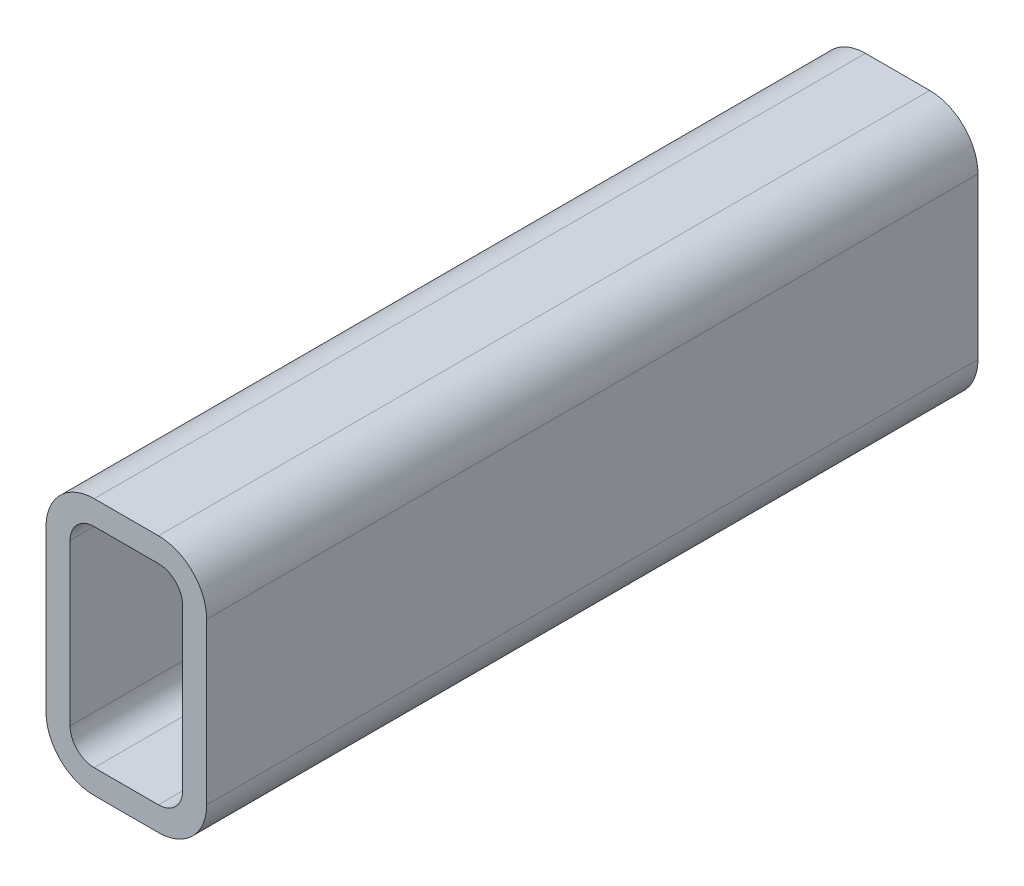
ISO-10303-21;
HEADER;
FILE_DESCRIPTION(('STEP AP214'),'2;1');
FILE_NAME('part.step','',(''),(''),'','','');
FILE_SCHEMA(('AUTOMOTIVE_DESIGN { 1 0 10303 214 1 1 1 1 }'));
ENDSEC;
DATA;
#1=APPLICATION_CONTEXT('core data for automotive mechanical design processes');
#2=APPLICATION_PROTOCOL_DEFINITION('international standard','automotive_design',2000,#1);
#3=PRODUCT_CONTEXT('',#1,'mechanical');
#4=PRODUCT('Part','Part','',(#3));
#5=PRODUCT_RELATED_PRODUCT_CATEGORY('part','',(#4));
#6=PRODUCT_DEFINITION_FORMATION('','',#4);
#7=PRODUCT_DEFINITION_CONTEXT('part definition',#1,'design');
#8=PRODUCT_DEFINITION('design','',#6,#7);
#9=PRODUCT_DEFINITION_SHAPE('','',#8);
#10=(LENGTH_UNIT() NAMED_UNIT(*) SI_UNIT(.MILLI.,.METRE.));
#11=(NAMED_UNIT(*) PLANE_ANGLE_UNIT() SI_UNIT($,.RADIAN.));
#12=(NAMED_UNIT(*) SI_UNIT($,.STERADIAN.) SOLID_ANGLE_UNIT());
#13=UNCERTAINTY_MEASURE_WITH_UNIT(LENGTH_MEASURE(1.E-05),#10,'distance_accuracy_value','');
#14=(GEOMETRIC_REPRESENTATION_CONTEXT(3) GLOBAL_UNCERTAINTY_ASSIGNED_CONTEXT((#13)) GLOBAL_UNIT_ASSIGNED_CONTEXT((#10,
#11,#12)) REPRESENTATION_CONTEXT('',''));
#15=CARTESIAN_POINT('',(0.,0.,0.));
#16=DIRECTION('',(0.,0.,1.));
#17=DIRECTION('',(1.,0.,0.));
#18=AXIS2_PLACEMENT_3D('',#15,#16,#17);
#19=CARTESIAN_POINT('',(21.9460851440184,84.6077651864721,304.8));
#20=DIRECTION('',(0.,0.,1.));
#21=DIRECTION('',(1.,0.,0.));
#22=AXIS2_PLACEMENT_3D('',#19,#20,#21);
#23=PLANE('',#22);
#24=CARTESIAN_POINT('',(21.9460851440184,84.6077651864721,304.8));
#25=DIRECTION('',(0.,0.,1.));
#26=DIRECTION('',(1.,0.,0.));
#27=AXIS2_PLACEMENT_3D('',#24,#25,#26);
#28=CIRCLE('',#27,19.05);
#29=CARTESIAN_POINT('',(21.9460851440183,103.657765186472,304.8));
#30=VERTEX_POINT('',#29);
#31=CARTESIAN_POINT('',(2.89608514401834,84.6077651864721,304.8));
#32=VERTEX_POINT('',#31);
#33=EDGE_CURVE('E211',#30,#32,#28,.T.);
#34=ORIENTED_EDGE('',*,*,#33,.T.);
#35=DIRECTION('',(0.,-1.,0.));
#36=VECTOR('',#35,1.);
#37=CARTESIAN_POINT('',(2.89608514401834,21.1077651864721,304.8));
#38=LINE('',#37,#36);
#39=CARTESIAN_POINT('',(2.89608514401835,21.1077651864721,304.8));
#40=VERTEX_POINT('',#39);
#41=EDGE_CURVE('E214',#32,#40,#38,.T.);
#42=ORIENTED_EDGE('',*,*,#41,.T.);
#43=CARTESIAN_POINT('',(21.9460851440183,21.1077651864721,304.8));
#44=DIRECTION('',(0.,0.,1.));
#45=DIRECTION('',(1.,0.,0.));
#46=AXIS2_PLACEMENT_3D('',#43,#44,#45);
#47=CIRCLE('',#46,19.05);
#48=CARTESIAN_POINT('',(21.9460851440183,2.05776518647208,304.8));
#49=VERTEX_POINT('',#48);
#50=EDGE_CURVE('E217',#40,#49,#47,.T.);
#51=ORIENTED_EDGE('',*,*,#50,.T.);
#52=DIRECTION('',(1.,0.,0.));
#53=VECTOR('',#52,1.);
#54=CARTESIAN_POINT('',(47.3460851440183,2.05776518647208,304.8));
#55=LINE('',#54,#53);
#56=CARTESIAN_POINT('',(47.3460851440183,2.05776518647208,304.8));
#57=VERTEX_POINT('',#56);
#58=EDGE_CURVE('E219',#49,#57,#55,.T.);
#59=ORIENTED_EDGE('',*,*,#58,.T.);
#60=CARTESIAN_POINT('',(47.3460851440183,21.1077651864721,304.8));
#61=DIRECTION('',(0.,0.,1.));
#62=DIRECTION('',(1.,0.,0.));
#63=AXIS2_PLACEMENT_3D('',#60,#61,#62);
#64=CIRCLE('',#63,19.05);
#65=CARTESIAN_POINT('',(66.3960851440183,21.1077651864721,304.8));
#66=VERTEX_POINT('',#65);
#67=EDGE_CURVE('E221',#57,#66,#64,.T.);
#68=ORIENTED_EDGE('',*,*,#67,.T.);
#69=DIRECTION('',(0.,1.,0.));
#70=VECTOR('',#69,1.);
#71=CARTESIAN_POINT('',(66.3960851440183,84.6077651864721,304.8));
#72=LINE('',#71,#70);
#73=CARTESIAN_POINT('',(66.3960851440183,84.6077651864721,304.8));
#74=VERTEX_POINT('',#73);
#75=EDGE_CURVE('E223',#66,#74,#72,.T.);
#76=ORIENTED_EDGE('',*,*,#75,.T.);
#77=CARTESIAN_POINT('',(47.3460851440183,84.6077651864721,304.8));
#78=DIRECTION('',(0.,0.,1.));
#79=DIRECTION('',(1.,0.,0.));
#80=AXIS2_PLACEMENT_3D('',#77,#78,#79);
#81=CIRCLE('',#80,19.05);
#82=CARTESIAN_POINT('',(47.3460851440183,103.657765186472,304.8));
#83=VERTEX_POINT('',#82);
#84=EDGE_CURVE('E225',#74,#83,#81,.T.);
#85=ORIENTED_EDGE('',*,*,#84,.T.);
#86=DIRECTION('',(-1.,0.,0.));
#87=VECTOR('',#86,1.);
#88=CARTESIAN_POINT('',(21.9460851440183,103.657765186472,304.8));
#89=LINE('',#88,#87);
#90=EDGE_CURVE('E227',#83,#30,#89,.T.);
#91=ORIENTED_EDGE('',*,*,#90,.T.);
#92=EDGE_LOOP('',(#34,#42,#51,#59,#68,#76,#85,#91));
#93=FACE_BOUND('',#92,.T.);
#94=DIRECTION('',(0.,-1.,0.));
#95=VECTOR('',#94,1.);
#96=CARTESIAN_POINT('',(12.4210851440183,21.1077651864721,304.8));
#97=LINE('',#96,#95);
#98=CARTESIAN_POINT('',(12.4210851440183,84.6077651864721,304.8));
#99=VERTEX_POINT('',#98);
#100=CARTESIAN_POINT('',(12.4210851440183,21.1077651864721,304.8));
#101=VERTEX_POINT('',#100);
#102=EDGE_CURVE('E154',#99,#101,#97,.T.);
#103=ORIENTED_EDGE('',*,*,#102,.F.);
#104=CARTESIAN_POINT('',(21.9460851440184,84.6077651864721,304.8));
#105=DIRECTION('',(0.,0.,1.));
#106=DIRECTION('',(1.,0.,0.));
#107=AXIS2_PLACEMENT_3D('',#104,#105,#106);
#108=CIRCLE('',#107,9.52500000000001);
#109=CARTESIAN_POINT('',(21.9460851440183,94.1327651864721,304.8));
#110=VERTEX_POINT('',#109);
#111=EDGE_CURVE('E146',#110,#99,#108,.T.);
#112=ORIENTED_EDGE('',*,*,#111,.F.);
#113=DIRECTION('',(-1.,0.,0.));
#114=VECTOR('',#113,1.);
#115=CARTESIAN_POINT('',(21.9460851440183,94.1327651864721,304.8));
#116=LINE('',#115,#114);
#117=CARTESIAN_POINT('',(47.3460851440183,94.1327651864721,304.8));
#118=VERTEX_POINT('',#117);
#119=EDGE_CURVE('E179',#118,#110,#116,.T.);
#120=ORIENTED_EDGE('',*,*,#119,.F.);
#121=CARTESIAN_POINT('',(47.3460851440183,84.6077651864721,304.8));
#122=DIRECTION('',(0.,0.,1.));
#123=DIRECTION('',(1.,0.,0.));
#124=AXIS2_PLACEMENT_3D('',#121,#122,#123);
#125=CIRCLE('',#124,9.52500000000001);
#126=CARTESIAN_POINT('',(56.8710851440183,84.6077651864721,304.8));
#127=VERTEX_POINT('',#126);
#128=EDGE_CURVE('E177',#127,#118,#125,.T.);
#129=ORIENTED_EDGE('',*,*,#128,.F.);
#130=DIRECTION('',(0.,1.,0.));
#131=VECTOR('',#130,1.);
#132=CARTESIAN_POINT('',(56.8710851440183,84.6077651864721,304.8));
#133=LINE('',#132,#131);
#134=CARTESIAN_POINT('',(56.8710851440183,21.1077651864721,304.8));
#135=VERTEX_POINT('',#134);
#136=EDGE_CURVE('E175',#135,#127,#133,.T.);
#137=ORIENTED_EDGE('',*,*,#136,.F.);
#138=CARTESIAN_POINT('',(47.3460851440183,21.1077651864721,304.8));
#139=DIRECTION('',(0.,0.,1.));
#140=DIRECTION('',(1.,0.,0.));
#141=AXIS2_PLACEMENT_3D('',#138,#139,#140);
#142=CIRCLE('',#141,9.525);
#143=CARTESIAN_POINT('',(47.3460851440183,11.5827651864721,304.8));
#144=VERTEX_POINT('',#143);
#145=EDGE_CURVE('E173',#144,#135,#142,.T.);
#146=ORIENTED_EDGE('',*,*,#145,.F.);
#147=DIRECTION('',(1.,0.,0.));
#148=VECTOR('',#147,1.);
#149=CARTESIAN_POINT('',(47.3460851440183,11.5827651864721,304.8));
#150=LINE('',#149,#148);
#151=CARTESIAN_POINT('',(21.9460851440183,11.5827651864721,304.8));
#152=VERTEX_POINT('',#151);
#153=EDGE_CURVE('E169',#152,#144,#150,.T.);
#154=ORIENTED_EDGE('',*,*,#153,.F.);
#155=CARTESIAN_POINT('',(21.9460851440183,21.1077651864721,304.8));
#156=DIRECTION('',(0.,0.,1.));
#157=DIRECTION('',(1.,0.,0.));
#158=AXIS2_PLACEMENT_3D('',#155,#156,#157);
#159=CIRCLE('',#158,9.525);
#160=EDGE_CURVE('E167',#101,#152,#159,.T.);
#161=ORIENTED_EDGE('',*,*,#160,.F.);
#162=EDGE_LOOP('',(#103,#112,#120,#129,#137,#146,#154,#161));
#163=FACE_BOUND('',#162,.T.);
#164=ADVANCED_FACE('F33',(#93,#163),#23,.T.);
#165=CARTESIAN_POINT('',(21.9460851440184,84.6077651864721,0.));
#166=DIRECTION('',(0.,0.,1.));
#167=DIRECTION('',(1.,0.,0.));
#168=AXIS2_PLACEMENT_3D('',#165,#166,#167);
#169=PLANE('',#168);
#170=CARTESIAN_POINT('',(21.9460851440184,84.6077651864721,0.));
#171=DIRECTION('',(0.,0.,1.));
#172=DIRECTION('',(1.,0.,0.));
#173=AXIS2_PLACEMENT_3D('',#170,#171,#172);
#174=CIRCLE('',#173,19.05);
#175=CARTESIAN_POINT('',(21.9460851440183,103.657765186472,0.));
#176=VERTEX_POINT('',#175);
#177=CARTESIAN_POINT('',(2.89608514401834,84.6077651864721,0.));
#178=VERTEX_POINT('',#177);
#179=EDGE_CURVE('E162',#176,#178,#174,.T.);
#180=ORIENTED_EDGE('',*,*,#179,.F.);
#181=DIRECTION('',(-1.,0.,0.));
#182=VECTOR('',#181,1.);
#183=CARTESIAN_POINT('',(21.9460851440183,103.657765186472,0.));
#184=LINE('',#183,#182);
#185=CARTESIAN_POINT('',(47.3460851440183,103.657765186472,0.));
#186=VERTEX_POINT('',#185);
#187=EDGE_CURVE('E215',#186,#176,#184,.T.);
#188=ORIENTED_EDGE('',*,*,#187,.F.);
#189=CARTESIAN_POINT('',(47.3460851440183,84.6077651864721,0.));
#190=DIRECTION('',(0.,0.,1.));
#191=DIRECTION('',(1.,0.,0.));
#192=AXIS2_PLACEMENT_3D('',#189,#190,#191);
#193=CIRCLE('',#192,19.05);
#194=CARTESIAN_POINT('',(66.3960851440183,84.6077651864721,0.));
#195=VERTEX_POINT('',#194);
#196=EDGE_CURVE('E242',#195,#186,#193,.T.);
#197=ORIENTED_EDGE('',*,*,#196,.F.);
#198=DIRECTION('',(0.,1.,0.));
#199=VECTOR('',#198,1.);
#200=CARTESIAN_POINT('',(66.3960851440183,84.6077651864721,0.));
#201=LINE('',#200,#199);
#202=CARTESIAN_POINT('',(66.3960851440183,21.1077651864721,0.));
#203=VERTEX_POINT('',#202);
#204=EDGE_CURVE('E240',#203,#195,#201,.T.);
#205=ORIENTED_EDGE('',*,*,#204,.F.);
#206=CARTESIAN_POINT('',(47.3460851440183,21.1077651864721,0.));
#207=DIRECTION('',(0.,0.,1.));
#208=DIRECTION('',(1.,0.,0.));
#209=AXIS2_PLACEMENT_3D('',#206,#207,#208);
#210=CIRCLE('',#209,19.05);
#211=CARTESIAN_POINT('',(47.3460851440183,2.05776518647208,0.));
#212=VERTEX_POINT('',#211);
#213=EDGE_CURVE('E238',#212,#203,#210,.T.);
#214=ORIENTED_EDGE('',*,*,#213,.F.);
#215=DIRECTION('',(1.,0.,0.));
#216=VECTOR('',#215,1.);
#217=CARTESIAN_POINT('',(47.3460851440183,2.05776518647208,0.));
#218=LINE('',#217,#216);
#219=CARTESIAN_POINT('',(21.9460851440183,2.05776518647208,0.));
#220=VERTEX_POINT('',#219);
#221=EDGE_CURVE('E236',#220,#212,#218,.T.);
#222=ORIENTED_EDGE('',*,*,#221,.F.);
#223=CARTESIAN_POINT('',(21.9460851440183,21.1077651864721,0.));
#224=DIRECTION('',(0.,0.,1.));
#225=DIRECTION('',(1.,0.,0.));
#226=AXIS2_PLACEMENT_3D('',#223,#224,#225);
#227=CIRCLE('',#226,19.05);
#228=CARTESIAN_POINT('',(2.89608514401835,21.1077651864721,0.));
#229=VERTEX_POINT('',#228);
#230=EDGE_CURVE('E234',#229,#220,#227,.T.);
#231=ORIENTED_EDGE('',*,*,#230,.F.);
#232=DIRECTION('',(0.,-1.,0.));
#233=VECTOR('',#232,1.);
#234=CARTESIAN_POINT('',(2.89608514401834,21.1077651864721,0.));
#235=LINE('',#234,#233);
#236=EDGE_CURVE('E232',#178,#229,#235,.T.);
#237=ORIENTED_EDGE('',*,*,#236,.F.);
#238=EDGE_LOOP('',(#180,#188,#197,#205,#214,#222,#231,#237));
#239=FACE_BOUND('',#238,.T.);
#240=CARTESIAN_POINT('',(21.9460851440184,84.6077651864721,0.));
#241=DIRECTION('',(0.,0.,1.));
#242=DIRECTION('',(1.,0.,0.));
#243=AXIS2_PLACEMENT_3D('',#240,#241,#242);
#244=CIRCLE('',#243,9.52500000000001);
#245=CARTESIAN_POINT('',(21.9460851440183,94.1327651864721,0.));
#246=VERTEX_POINT('',#245);
#247=CARTESIAN_POINT('',(12.4210851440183,84.6077651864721,0.));
#248=VERTEX_POINT('',#247);
#249=EDGE_CURVE('E56',#246,#248,#244,.T.);
#250=ORIENTED_EDGE('',*,*,#249,.T.);
#251=DIRECTION('',(0.,-1.,0.));
#252=VECTOR('',#251,1.);
#253=CARTESIAN_POINT('',(12.4210851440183,21.1077651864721,0.));
#254=LINE('',#253,#252);
#255=CARTESIAN_POINT('',(12.4210851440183,21.1077651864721,0.));
#256=VERTEX_POINT('',#255);
#257=EDGE_CURVE('E161',#248,#256,#254,.T.);
#258=ORIENTED_EDGE('',*,*,#257,.T.);
#259=CARTESIAN_POINT('',(21.9460851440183,21.1077651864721,0.));
#260=DIRECTION('',(0.,0.,1.));
#261=DIRECTION('',(1.,0.,0.));
#262=AXIS2_PLACEMENT_3D('',#259,#260,#261);
#263=CIRCLE('',#262,9.525);
#264=CARTESIAN_POINT('',(21.9460851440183,11.5827651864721,0.));
#265=VERTEX_POINT('',#264);
#266=EDGE_CURVE('E183',#256,#265,#263,.T.);
#267=ORIENTED_EDGE('',*,*,#266,.T.);
#268=DIRECTION('',(1.,0.,0.));
#269=VECTOR('',#268,1.);
#270=CARTESIAN_POINT('',(47.3460851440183,11.5827651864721,0.));
#271=LINE('',#270,#269);
#272=CARTESIAN_POINT('',(47.3460851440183,11.5827651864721,0.));
#273=VERTEX_POINT('',#272);
#274=EDGE_CURVE('E186',#265,#273,#271,.T.);
#275=ORIENTED_EDGE('',*,*,#274,.T.);
#276=CARTESIAN_POINT('',(47.3460851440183,21.1077651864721,0.));
#277=DIRECTION('',(0.,0.,1.));
#278=DIRECTION('',(1.,0.,0.));
#279=AXIS2_PLACEMENT_3D('',#276,#277,#278);
#280=CIRCLE('',#279,9.525);
#281=CARTESIAN_POINT('',(56.8710851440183,21.1077651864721,0.));
#282=VERTEX_POINT('',#281);
#283=EDGE_CURVE('E189',#273,#282,#280,.T.);
#284=ORIENTED_EDGE('',*,*,#283,.T.);
#285=DIRECTION('',(0.,1.,0.));
#286=VECTOR('',#285,1.);
#287=CARTESIAN_POINT('',(56.8710851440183,84.6077651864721,0.));
#288=LINE('',#287,#286);
#289=CARTESIAN_POINT('',(56.8710851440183,84.6077651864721,0.));
#290=VERTEX_POINT('',#289);
#291=EDGE_CURVE('E192',#282,#290,#288,.T.);
#292=ORIENTED_EDGE('',*,*,#291,.T.);
#293=CARTESIAN_POINT('',(47.3460851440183,84.6077651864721,0.));
#294=DIRECTION('',(0.,0.,1.));
#295=DIRECTION('',(1.,0.,0.));
#296=AXIS2_PLACEMENT_3D('',#293,#294,#295);
#297=CIRCLE('',#296,9.52500000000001);
#298=CARTESIAN_POINT('',(47.3460851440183,94.1327651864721,0.));
#299=VERTEX_POINT('',#298);
#300=EDGE_CURVE('E195',#290,#299,#297,.T.);
#301=ORIENTED_EDGE('',*,*,#300,.T.);
#302=DIRECTION('',(-1.,0.,0.));
#303=VECTOR('',#302,1.);
#304=CARTESIAN_POINT('',(21.9460851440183,94.1327651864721,0.));
#305=LINE('',#304,#303);
#306=EDGE_CURVE('E155',#299,#246,#305,.T.);
#307=ORIENTED_EDGE('',*,*,#306,.T.);
#308=EDGE_LOOP('',(#250,#258,#267,#275,#284,#292,#301,#307));
#309=FACE_BOUND('',#308,.T.);
#310=ADVANCED_FACE('F272',(#239,#309),#169,.F.);
#311=CARTESIAN_POINT('',(21.9460851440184,84.6077651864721,304.8));
#312=DIRECTION('',(0.,0.,-1.));
#313=DIRECTION('',(-1.,0.,0.));
#314=AXIS2_PLACEMENT_3D('',#311,#312,#313);
#315=CYLINDRICAL_SURFACE('',#314,19.05);
#316=ORIENTED_EDGE('',*,*,#179,.T.);
#317=DIRECTION('',(0.,0.,-1.));
#318=VECTOR('',#317,1.);
#319=CARTESIAN_POINT('',(2.89608514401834,84.6077651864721,304.8));
#320=LINE('',#319,#318);
#321=EDGE_CURVE('E11',#32,#178,#320,.T.);
#322=ORIENTED_EDGE('',*,*,#321,.F.);
#323=ORIENTED_EDGE('',*,*,#33,.F.);
#324=DIRECTION('',(0.,0.,-1.));
#325=VECTOR('',#324,1.);
#326=CARTESIAN_POINT('',(21.9460851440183,103.657765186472,304.8));
#327=LINE('',#326,#325);
#328=EDGE_CURVE('E229',#30,#176,#327,.T.);
#329=ORIENTED_EDGE('',*,*,#328,.T.);
#330=EDGE_LOOP('',(#316,#322,#323,#329));
#331=FACE_BOUND('',#330,.T.);
#332=ADVANCED_FACE('F35',(#331),#315,.T.);
#333=CARTESIAN_POINT('',(2.89608514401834,21.1077651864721,304.8));
#334=DIRECTION('',(1.,0.,0.));
#335=DIRECTION('',(0.,0.,-1.));
#336=AXIS2_PLACEMENT_3D('',#333,#334,#335);
#337=PLANE('',#336);
#338=ORIENTED_EDGE('',*,*,#236,.T.);
#339=DIRECTION('',(0.,0.,-1.));
#340=VECTOR('',#339,1.);
#341=CARTESIAN_POINT('',(2.89608514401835,21.1077651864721,304.8));
#342=LINE('',#341,#340);
#343=EDGE_CURVE('E41',#40,#229,#342,.T.);
#344=ORIENTED_EDGE('',*,*,#343,.F.);
#345=ORIENTED_EDGE('',*,*,#41,.F.);
#346=ORIENTED_EDGE('',*,*,#321,.T.);
#347=EDGE_LOOP('',(#338,#344,#345,#346));
#348=FACE_BOUND('',#347,.T.);
#349=ADVANCED_FACE('F289',(#348),#337,.F.);
#350=CARTESIAN_POINT('',(21.9460851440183,21.1077651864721,304.8));
#351=DIRECTION('',(0.,0.,-1.));
#352=DIRECTION('',(-1.,0.,0.));
#353=AXIS2_PLACEMENT_3D('',#350,#351,#352);
#354=CYLINDRICAL_SURFACE('',#353,19.05);
#355=ORIENTED_EDGE('',*,*,#230,.T.);
#356=DIRECTION('',(0.,0.,-1.));
#357=VECTOR('',#356,1.);
#358=CARTESIAN_POINT('',(21.9460851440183,2.05776518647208,304.8));
#359=LINE('',#358,#357);
#360=EDGE_CURVE('E259',#49,#220,#359,.T.);
#361=ORIENTED_EDGE('',*,*,#360,.F.);
#362=ORIENTED_EDGE('',*,*,#50,.F.);
#363=ORIENTED_EDGE('',*,*,#343,.T.);
#364=EDGE_LOOP('',(#355,#361,#362,#363));
#365=FACE_BOUND('',#364,.T.);
#366=ADVANCED_FACE('F266',(#365),#354,.T.);
#367=CARTESIAN_POINT('',(47.3460851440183,2.05776518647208,304.8));
#368=DIRECTION('',(0.,1.,0.));
#369=DIRECTION('',(0.,0.,1.));
#370=AXIS2_PLACEMENT_3D('',#367,#368,#369);
#371=PLANE('',#370);
#372=ORIENTED_EDGE('',*,*,#221,.T.);
#373=DIRECTION('',(0.,0.,-1.));
#374=VECTOR('',#373,1.);
#375=CARTESIAN_POINT('',(47.3460851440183,2.05776518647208,304.8));
#376=LINE('',#375,#374);
#377=EDGE_CURVE('E256',#57,#212,#376,.T.);
#378=ORIENTED_EDGE('',*,*,#377,.F.);
#379=ORIENTED_EDGE('',*,*,#58,.F.);
#380=ORIENTED_EDGE('',*,*,#360,.T.);
#381=EDGE_LOOP('',(#372,#378,#379,#380));
#382=FACE_BOUND('',#381,.T.);
#383=ADVANCED_FACE('F278',(#382),#371,.F.);
#384=CARTESIAN_POINT('',(47.3460851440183,21.1077651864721,304.8));
#385=DIRECTION('',(0.,0.,-1.));
#386=DIRECTION('',(-1.,0.,0.));
#387=AXIS2_PLACEMENT_3D('',#384,#385,#386);
#388=CYLINDRICAL_SURFACE('',#387,19.05);
#389=ORIENTED_EDGE('',*,*,#213,.T.);
#390=DIRECTION('',(0.,0.,-1.));
#391=VECTOR('',#390,1.);
#392=CARTESIAN_POINT('',(66.3960851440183,21.1077651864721,304.8));
#393=LINE('',#392,#391);
#394=EDGE_CURVE('E253',#66,#203,#393,.T.);
#395=ORIENTED_EDGE('',*,*,#394,.F.);
#396=ORIENTED_EDGE('',*,*,#67,.F.);
#397=ORIENTED_EDGE('',*,*,#377,.T.);
#398=EDGE_LOOP('',(#389,#395,#396,#397));
#399=FACE_BOUND('',#398,.T.);
#400=ADVANCED_FACE('F282',(#399),#388,.T.);
#401=CARTESIAN_POINT('',(66.3960851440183,84.6077651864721,304.8));
#402=DIRECTION('',(-1.,0.,0.));
#403=DIRECTION('',(0.,0.,1.));
#404=AXIS2_PLACEMENT_3D('',#401,#402,#403);
#405=PLANE('',#404);
#406=ORIENTED_EDGE('',*,*,#204,.T.);
#407=DIRECTION('',(0.,0.,-1.));
#408=VECTOR('',#407,1.);
#409=CARTESIAN_POINT('',(66.3960851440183,84.6077651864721,304.8));
#410=LINE('',#409,#408);
#411=EDGE_CURVE('E250',#74,#195,#410,.T.);
#412=ORIENTED_EDGE('',*,*,#411,.F.);
#413=ORIENTED_EDGE('',*,*,#75,.F.);
#414=ORIENTED_EDGE('',*,*,#394,.T.);
#415=EDGE_LOOP('',(#406,#412,#413,#414));
#416=FACE_BOUND('',#415,.T.);
#417=ADVANCED_FACE('F302',(#416),#405,.F.);
#418=CARTESIAN_POINT('',(47.3460851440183,84.6077651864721,304.8));
#419=DIRECTION('',(0.,0.,-1.));
#420=DIRECTION('',(-1.,0.,0.));
#421=AXIS2_PLACEMENT_3D('',#418,#419,#420);
#422=CYLINDRICAL_SURFACE('',#421,19.05);
#423=ORIENTED_EDGE('',*,*,#196,.T.);
#424=DIRECTION('',(0.,0.,-1.));
#425=VECTOR('',#424,1.);
#426=CARTESIAN_POINT('',(47.3460851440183,103.657765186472,304.8));
#427=LINE('',#426,#425);
#428=EDGE_CURVE('E247',#83,#186,#427,.T.);
#429=ORIENTED_EDGE('',*,*,#428,.F.);
#430=ORIENTED_EDGE('',*,*,#84,.F.);
#431=ORIENTED_EDGE('',*,*,#411,.T.);
#432=EDGE_LOOP('',(#423,#429,#430,#431));
#433=FACE_BOUND('',#432,.T.);
#434=ADVANCED_FACE('F300',(#433),#422,.T.);
#435=CARTESIAN_POINT('',(21.9460851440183,103.657765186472,304.8));
#436=DIRECTION('',(0.,-1.,0.));
#437=DIRECTION('',(0.,0.,-1.));
#438=AXIS2_PLACEMENT_3D('',#435,#436,#437);
#439=PLANE('',#438);
#440=ORIENTED_EDGE('',*,*,#187,.T.);
#441=ORIENTED_EDGE('',*,*,#328,.F.);
#442=ORIENTED_EDGE('',*,*,#90,.F.);
#443=ORIENTED_EDGE('',*,*,#428,.T.);
#444=EDGE_LOOP('',(#440,#441,#442,#443));
#445=FACE_BOUND('',#444,.T.);
#446=ADVANCED_FACE('F295',(#445),#439,.F.);
#447=CARTESIAN_POINT('',(21.9460851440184,84.6077651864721,304.8));
#448=DIRECTION('',(0.,0.,-1.));
#449=DIRECTION('',(-1.,0.,0.));
#450=AXIS2_PLACEMENT_3D('',#447,#448,#449);
#451=CYLINDRICAL_SURFACE('',#450,9.52500000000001);
#452=ORIENTED_EDGE('',*,*,#249,.F.);
#453=DIRECTION('',(0.,0.,-1.));
#454=VECTOR('',#453,1.);
#455=CARTESIAN_POINT('',(21.9460851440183,94.1327651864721,304.8));
#456=LINE('',#455,#454);
#457=EDGE_CURVE('E150',#110,#246,#456,.T.);
#458=ORIENTED_EDGE('',*,*,#457,.F.);
#459=ORIENTED_EDGE('',*,*,#111,.T.);
#460=DIRECTION('',(0.,0.,-1.));
#461=VECTOR('',#460,1.);
#462=CARTESIAN_POINT('',(12.4210851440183,84.6077651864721,304.8));
#463=LINE('',#462,#461);
#464=EDGE_CURVE('E149',#99,#248,#463,.T.);
#465=ORIENTED_EDGE('',*,*,#464,.T.);
#466=EDGE_LOOP('',(#452,#458,#459,#465));
#467=FACE_BOUND('',#466,.T.);
#468=ADVANCED_FACE('F148',(#467),#451,.F.);
#469=CARTESIAN_POINT('',(12.4210851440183,21.1077651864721,304.8));
#470=DIRECTION('',(1.,0.,0.));
#471=DIRECTION('',(0.,0.,-1.));
#472=AXIS2_PLACEMENT_3D('',#469,#470,#471);
#473=PLANE('',#472);
#474=ORIENTED_EDGE('',*,*,#257,.F.);
#475=ORIENTED_EDGE('',*,*,#464,.F.);
#476=ORIENTED_EDGE('',*,*,#102,.T.);
#477=DIRECTION('',(0.,0.,-1.));
#478=VECTOR('',#477,1.);
#479=CARTESIAN_POINT('',(12.4210851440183,21.1077651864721,304.8));
#480=LINE('',#479,#478);
#481=EDGE_CURVE('E163',#101,#256,#480,.T.);
#482=ORIENTED_EDGE('',*,*,#481,.T.);
#483=EDGE_LOOP('',(#474,#475,#476,#482));
#484=FACE_BOUND('',#483,.T.);
#485=ADVANCED_FACE('F158',(#484),#473,.T.);
#486=CARTESIAN_POINT('',(21.9460851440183,21.1077651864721,304.8));
#487=DIRECTION('',(0.,0.,-1.));
#488=DIRECTION('',(-1.,0.,0.));
#489=AXIS2_PLACEMENT_3D('',#486,#487,#488);
#490=CYLINDRICAL_SURFACE('',#489,9.525);
#491=ORIENTED_EDGE('',*,*,#266,.F.);
#492=ORIENTED_EDGE('',*,*,#481,.F.);
#493=ORIENTED_EDGE('',*,*,#160,.T.);
#494=DIRECTION('',(0.,0.,-1.));
#495=VECTOR('',#494,1.);
#496=CARTESIAN_POINT('',(21.9460851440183,11.5827651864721,304.8));
#497=LINE('',#496,#495);
#498=EDGE_CURVE('E208',#152,#265,#497,.T.);
#499=ORIENTED_EDGE('',*,*,#498,.T.);
#500=EDGE_LOOP('',(#491,#492,#493,#499));
#501=FACE_BOUND('',#500,.T.);
#502=ADVANCED_FACE('F327',(#501),#490,.F.);
#503=CARTESIAN_POINT('',(47.3460851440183,11.5827651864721,304.8));
#504=DIRECTION('',(0.,1.,0.));
#505=DIRECTION('',(0.,0.,1.));
#506=AXIS2_PLACEMENT_3D('',#503,#504,#505);
#507=PLANE('',#506);
#508=ORIENTED_EDGE('',*,*,#274,.F.);
#509=ORIENTED_EDGE('',*,*,#498,.F.);
#510=ORIENTED_EDGE('',*,*,#153,.T.);
#511=DIRECTION('',(0.,0.,-1.));
#512=VECTOR('',#511,1.);
#513=CARTESIAN_POINT('',(47.3460851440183,11.5827651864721,304.8));
#514=LINE('',#513,#512);
#515=EDGE_CURVE('E206',#144,#273,#514,.T.);
#516=ORIENTED_EDGE('',*,*,#515,.T.);
#517=EDGE_LOOP('',(#508,#509,#510,#516));
#518=FACE_BOUND('',#517,.T.);
#519=ADVANCED_FACE('F331',(#518),#507,.T.);
#520=CARTESIAN_POINT('',(47.3460851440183,21.1077651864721,304.8));
#521=DIRECTION('',(0.,0.,-1.));
#522=DIRECTION('',(-1.,0.,0.));
#523=AXIS2_PLACEMENT_3D('',#520,#521,#522);
#524=CYLINDRICAL_SURFACE('',#523,9.525);
#525=ORIENTED_EDGE('',*,*,#283,.F.);
#526=ORIENTED_EDGE('',*,*,#515,.F.);
#527=ORIENTED_EDGE('',*,*,#145,.T.);
#528=DIRECTION('',(0.,0.,-1.));
#529=VECTOR('',#528,1.);
#530=CARTESIAN_POINT('',(56.8710851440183,21.1077651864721,304.8));
#531=LINE('',#530,#529);
#532=EDGE_CURVE('E204',#135,#282,#531,.T.);
#533=ORIENTED_EDGE('',*,*,#532,.T.);
#534=EDGE_LOOP('',(#525,#526,#527,#533));
#535=FACE_BOUND('',#534,.T.);
#536=ADVANCED_FACE('F337',(#535),#524,.F.);
#537=CARTESIAN_POINT('',(56.8710851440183,84.6077651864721,304.8));
#538=DIRECTION('',(-1.,0.,0.));
#539=DIRECTION('',(0.,0.,1.));
#540=AXIS2_PLACEMENT_3D('',#537,#538,#539);
#541=PLANE('',#540);
#542=ORIENTED_EDGE('',*,*,#291,.F.);
#543=ORIENTED_EDGE('',*,*,#532,.F.);
#544=ORIENTED_EDGE('',*,*,#136,.T.);
#545=DIRECTION('',(0.,0.,-1.));
#546=VECTOR('',#545,1.);
#547=CARTESIAN_POINT('',(56.8710851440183,84.6077651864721,304.8));
#548=LINE('',#547,#546);
#549=EDGE_CURVE('E202',#127,#290,#548,.T.);
#550=ORIENTED_EDGE('',*,*,#549,.T.);
#551=EDGE_LOOP('',(#542,#543,#544,#550));
#552=FACE_BOUND('',#551,.T.);
#553=ADVANCED_FACE('F341',(#552),#541,.T.);
#554=CARTESIAN_POINT('',(47.3460851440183,84.6077651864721,304.8));
#555=DIRECTION('',(0.,0.,-1.));
#556=DIRECTION('',(-1.,0.,0.));
#557=AXIS2_PLACEMENT_3D('',#554,#555,#556);
#558=CYLINDRICAL_SURFACE('',#557,9.52500000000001);
#559=ORIENTED_EDGE('',*,*,#300,.F.);
#560=ORIENTED_EDGE('',*,*,#549,.F.);
#561=ORIENTED_EDGE('',*,*,#128,.T.);
#562=DIRECTION('',(0.,0.,-1.));
#563=VECTOR('',#562,1.);
#564=CARTESIAN_POINT('',(47.3460851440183,94.1327651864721,304.8));
#565=LINE('',#564,#563);
#566=EDGE_CURVE('E48',#118,#299,#565,.T.);
#567=ORIENTED_EDGE('',*,*,#566,.T.);
#568=EDGE_LOOP('',(#559,#560,#561,#567));
#569=FACE_BOUND('',#568,.T.);
#570=ADVANCED_FACE('F345',(#569),#558,.F.);
#571=CARTESIAN_POINT('',(21.9460851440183,94.1327651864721,304.8));
#572=DIRECTION('',(0.,-1.,0.));
#573=DIRECTION('',(0.,0.,-1.));
#574=AXIS2_PLACEMENT_3D('',#571,#572,#573);
#575=PLANE('',#574);
#576=ORIENTED_EDGE('',*,*,#306,.F.);
#577=ORIENTED_EDGE('',*,*,#566,.F.);
#578=ORIENTED_EDGE('',*,*,#119,.T.);
#579=ORIENTED_EDGE('',*,*,#457,.T.);
#580=EDGE_LOOP('',(#576,#577,#578,#579));
#581=FACE_BOUND('',#580,.T.);
#582=ADVANCED_FACE('F349',(#581),#575,.T.);
#583=CLOSED_SHELL('',(#164,#310,#332,#349,#366,#383,#400,#417,#434,#446,#468,#485,#502,#519,
#536,#553,#570,#582));
#584=MANIFOLD_SOLID_BREP('B2',#583);
#585=ADVANCED_BREP_SHAPE_REPRESENTATION('',(#18,#584),#14);
#586=SHAPE_DEFINITION_REPRESENTATION(#9,#585);
ENDSEC;
END-ISO-10303-21;
